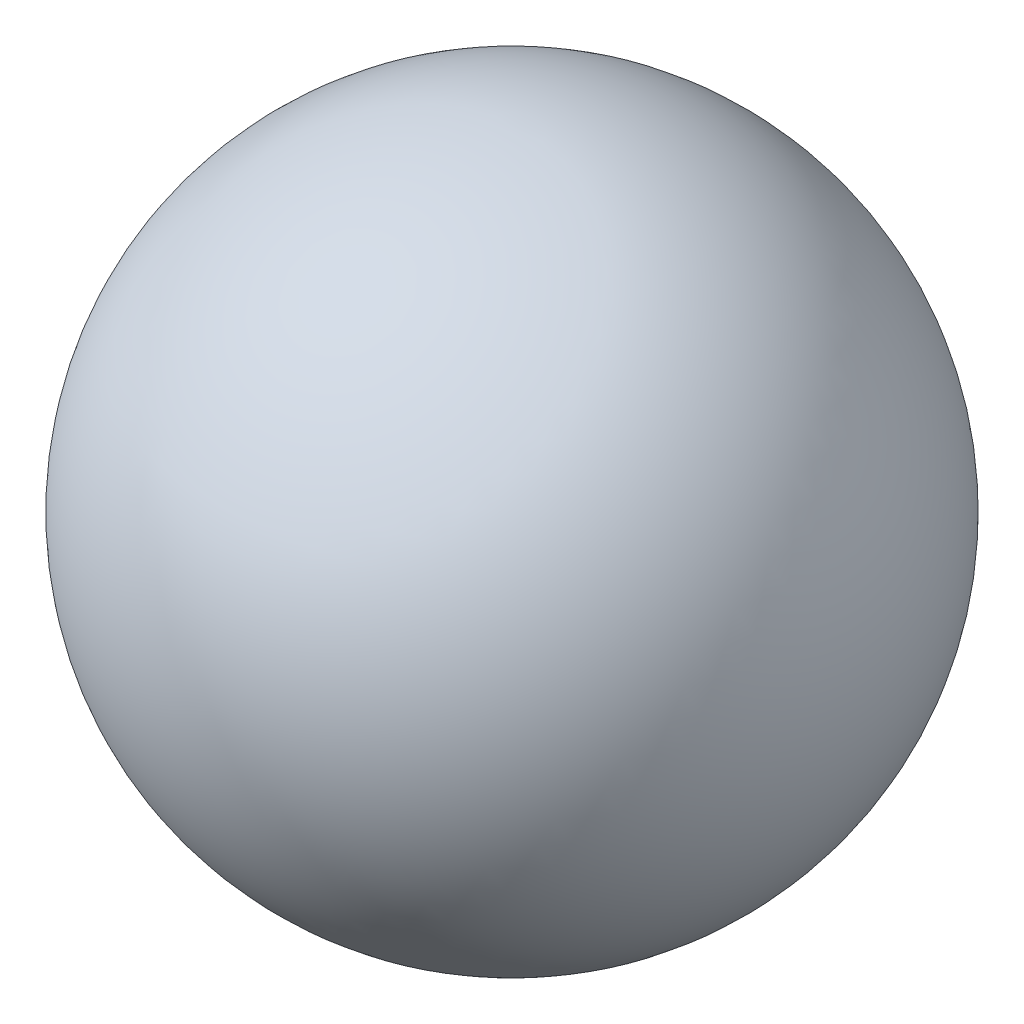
ISO-10303-21;
HEADER;
FILE_DESCRIPTION(('STEP AP214'),'2;1');
FILE_NAME('part.step','',(''),(''),'','','');
FILE_SCHEMA(('AUTOMOTIVE_DESIGN { 1 0 10303 214 1 1 1 1 }'));
ENDSEC;
DATA;
#1=APPLICATION_CONTEXT('core data for automotive mechanical design processes');
#2=APPLICATION_PROTOCOL_DEFINITION('international standard','automotive_design',2000,#1);
#3=PRODUCT_CONTEXT('',#1,'mechanical');
#4=PRODUCT('Part','Part','',(#3));
#5=PRODUCT_RELATED_PRODUCT_CATEGORY('part','',(#4));
#6=PRODUCT_DEFINITION_FORMATION('','',#4);
#7=PRODUCT_DEFINITION_CONTEXT('part definition',#1,'design');
#8=PRODUCT_DEFINITION('design','',#6,#7);
#9=PRODUCT_DEFINITION_SHAPE('','',#8);
#10=(LENGTH_UNIT() NAMED_UNIT(*) SI_UNIT(.MILLI.,.METRE.));
#11=(NAMED_UNIT(*) PLANE_ANGLE_UNIT() SI_UNIT($,.RADIAN.));
#12=(NAMED_UNIT(*) SI_UNIT($,.STERADIAN.) SOLID_ANGLE_UNIT());
#13=UNCERTAINTY_MEASURE_WITH_UNIT(LENGTH_MEASURE(1.E-05),#10,'distance_accuracy_value','');
#14=(GEOMETRIC_REPRESENTATION_CONTEXT(3) GLOBAL_UNCERTAINTY_ASSIGNED_CONTEXT((#13)) GLOBAL_UNIT_ASSIGNED_CONTEXT((#10,
#11,#12)) REPRESENTATION_CONTEXT('',''));
#15=CARTESIAN_POINT('',(0.,0.,0.));
#16=DIRECTION('',(0.,0.,1.));
#17=DIRECTION('',(1.,0.,0.));
#18=AXIS2_PLACEMENT_3D('',#15,#16,#17);
#19=CARTESIAN_POINT('',(0.,0.,0.));
#20=DIRECTION('',(0.,-1.,0.));
#21=DIRECTION('',(-1.,0.,0.));
#22=AXIS2_PLACEMENT_3D('',#19,#20,#21);
#23=SPHERICAL_SURFACE('',#22,6.39);
#24=CARTESIAN_POINT('',(0.,-6.39,0.));
#25=VERTEX_POINT('',#24);
#26=VERTEX_LOOP('',#25);
#27=FACE_BOUND('',#26,.T.);
#28=ADVANCED_FACE('F30',(#27),#23,.T.);
#29=CLOSED_SHELL('',(#28));
#30=MANIFOLD_SOLID_BREP('B2',#29);
#31=ADVANCED_BREP_SHAPE_REPRESENTATION('',(#18,#30),#14);
#32=SHAPE_DEFINITION_REPRESENTATION(#9,#31);
ENDSEC;
END-ISO-10303-21;
